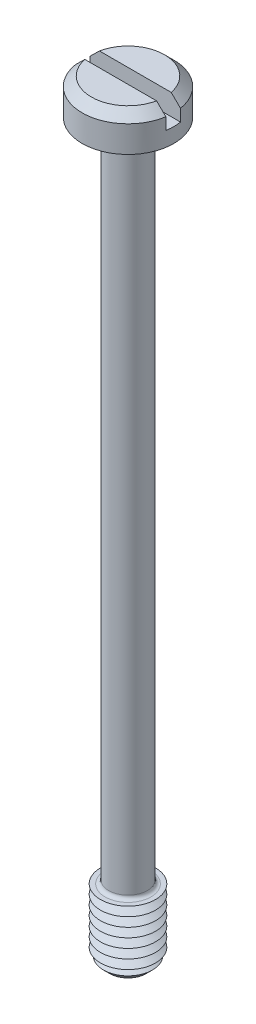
from build123d import *

# Parameters (mm, degrees)
SKETCH1_R           = 5
BOSS_EXTRUDE1_DEPTH = 3.9
SKETCH2_R           = 2.1
BOSS_EXTRUDE2_DEPTH = 80
SKETCH3_R           = 3
BOSS_EXTRUDE3_DEPTH = 7.5
CHAMFER1_SIZE       = 1
LPATTERN1_COUNT     = 7
LPATTERN1_PITCH     = 1
FILLET1_R           = 0.4
CHAMFER2_SIZE       = 1
SKETCH6_W           = 10
SKETCH6_H           = 1.6
CUT_EXTRUDE1_DEPTH  = 2.3


with BuildPart() as part:
    # Sketch1 → Boss-Extrude1 (new body)
    with BuildSketch(Plane(origin=(0, 0, 0), x_dir=(1, 0, 0), z_dir=(0, 1, 0))):
        with Locations(Location((0, 0, 0), (0, 0, 270))):
            Circle(SKETCH1_R)
    extrude(amount=BOSS_EXTRUDE1_DEPTH)

    # Sketch2 → Boss-Extrude2 (add)
    with BuildSketch(Plane.XZ):
        with Locations(Location((0, 0, 0), (0, 0, 270))):
            Circle(SKETCH2_R)
    extrude(amount=BOSS_EXTRUDE2_DEPTH)

    # Sketch3 → Boss-Extrude3 (add)
    with BuildSketch(Plane.XZ.offset(80)):
        with Locations(Location((0, 0, 0), (0, 0, 270))):
            Circle(SKETCH3_R)
    extrude(amount=-BOSS_EXTRUDE3_DEPTH)

    # Chamfer1
    chamfer1_edges = [part.edges().sort_by_distance(p)[0] for p in [
        (0, -80, 3),
    ]]
    chamfer(chamfer1_edges, length=CHAMFER1_SIZE)

    # Sketch5 → Cut-Revolve1 (revolve, cut)
    with BuildSketch(Plane(origin=(0, 0, 0), x_dir=(0, 0, -1), z_dir=(1, 0, 0))):
        Polygon((-3, -72.5), (-2.133974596, -73), (-3, -73.5), align=None)
    cut_revolve1 = revolve(axis=Axis((0, -6.58711856, 0), (0, -1, 0)), mode=Mode.SUBTRACT)

    # LPattern1: Cut-Revolve1 ×7
    with Locations(*[(0, -i * LPATTERN1_PITCH, 0) for i in range(1, LPATTERN1_COUNT)]):
        add(cut_revolve1, mode=Mode.SUBTRACT)

    # Fillet1
    fillet1_edges = [part.edges().sort_by_distance(p)[0] for p in [
        (0, 0, 2.1),
        (0, -72.5, 2.1),
    ]]
    fillet(fillet1_edges, radius=FILLET1_R)

    # Chamfer2
    chamfer2_edges = [part.edges().sort_by_distance(p)[0] for p in [
        (0, 3.9, -5),
    ]]
    chamfer(chamfer2_edges, length=CHAMFER2_SIZE)

    # Sketch6 → Cut-Extrude1 (cut)
    with BuildSketch(Plane(origin=(0, 3.9, 0), x_dir=(1, 0, 0), z_dir=(0, 1, 0))):
        Rectangle(SKETCH6_W, SKETCH6_H)
    extrude(amount=-CUT_EXTRUDE1_DEPTH, mode=Mode.SUBTRACT)


solid = part.part
